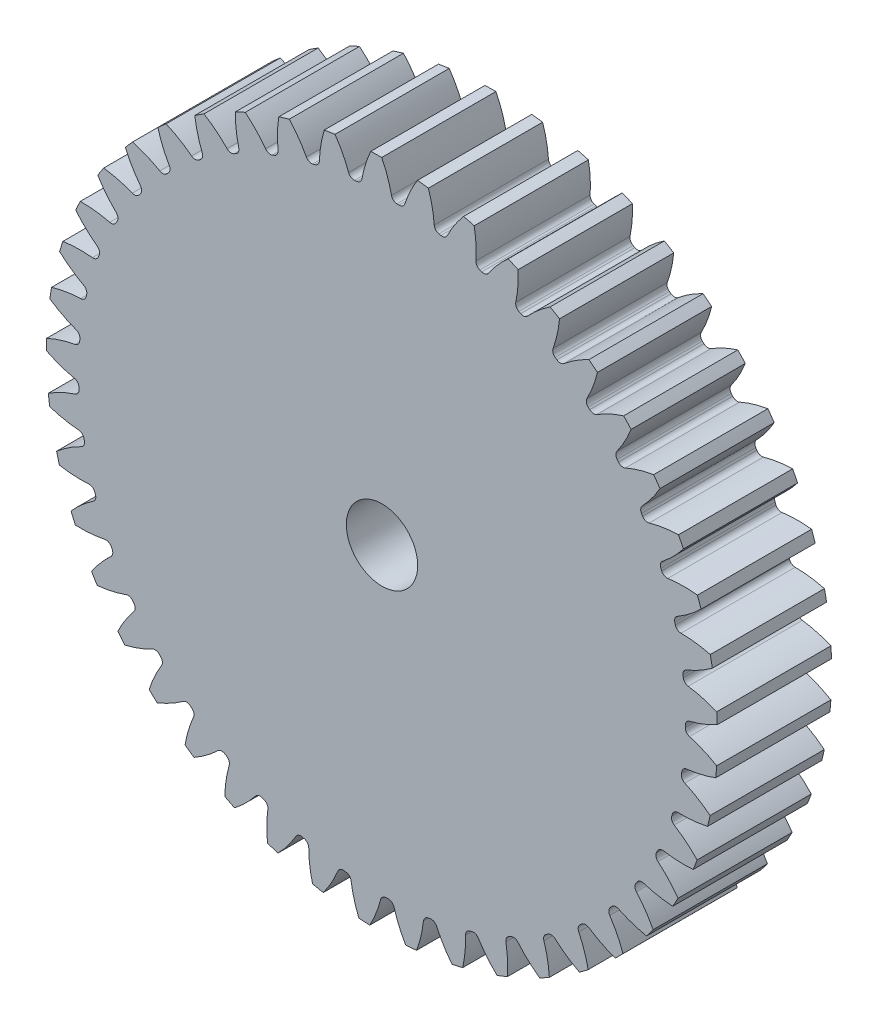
from build123d import *

# Parameters (mm, degrees)
SKETCH3_R         = 298.45
GEARBODY_DEPTH    = 101.6
TOOTHCUT_DEPTH    = 435.128281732
CIRPATTERN1_COUNT = 45
BOREDIA_R         = 31.75
BORE_DEPTH        = 12700


with BuildPart() as part:
    # Sketch3 → gearBody (new body)
    with BuildSketch(Plane.XY):
        Circle(SKETCH3_R)
    extrude(amount=GEARBODY_DEPTH)

    # Sketch2 → toothCut (cut, through all)
    with BuildSketch(Plane.XY):
        with BuildLine():
            ThreePointArc((269.814796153, -5.700122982), (269.832740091, -4.775772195), (269.847517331, -3.851365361))
            ThreePointArc((269.847517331, -3.851365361), (270.960750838, -0.719921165), (273.750410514, 1.086464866))
            ThreePointArc((273.750410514, 1.086464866), (286.408268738, 5.151932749), (298.45, 10.786301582))
            ThreePointArc((298.45, 10.786301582), (298.59808562, -5.284890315), (297.881382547, -21.340776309))
            ThreePointArc((297.881382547, -21.340776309), (286.046576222, -15.283816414), (273.540510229, -10.772972))
            ThreePointArc((273.540510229, -10.772972), (270.816520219, -8.868999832), (269.814796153, -5.700122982))
        make_face()
    toothcut = extrude(amount=TOOTHCUT_DEPTH, mode=Mode.SUBTRACT)

    # CirPattern1: toothCut ×45 about axis
    cirpattern1_axis = Axis((0, 0, 0), (0, 0, 1))
    for i in range(1, CIRPATTERN1_COUNT):
        add(toothcut.rotate(cirpattern1_axis, i * 360 / CIRPATTERN1_COUNT), mode=Mode.SUBTRACT)

    # boreDia → bore (cut, symmetric)
    with BuildSketch(Plane.XY):
        Circle(BOREDIA_R)
    extrude(amount=BORE_DEPTH, both=True, mode=Mode.SUBTRACT)


solid = part.part
